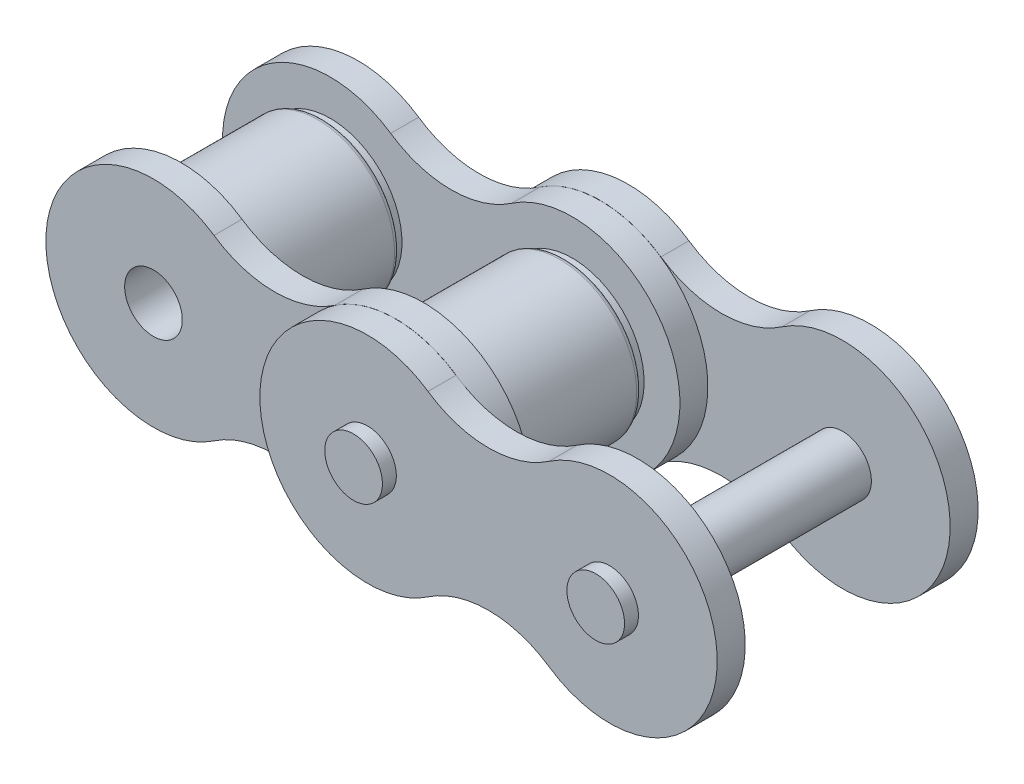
ISO-10303-21;
HEADER;
FILE_DESCRIPTION(('STEP AP214'),'2;1');
FILE_NAME('part.step','',(''),(''),'','','');
FILE_SCHEMA(('AUTOMOTIVE_DESIGN { 1 0 10303 214 1 1 1 1 }'));
ENDSEC;
DATA;
#1=APPLICATION_CONTEXT('core data for automotive mechanical design processes');
#2=APPLICATION_PROTOCOL_DEFINITION('international standard','automotive_design',2000,#1);
#3=PRODUCT_CONTEXT('',#1,'mechanical');
#4=PRODUCT('Part','Part','',(#3));
#5=PRODUCT_RELATED_PRODUCT_CATEGORY('part','',(#4));
#6=PRODUCT_DEFINITION_FORMATION('','',#4);
#7=PRODUCT_DEFINITION_CONTEXT('part definition',#1,'design');
#8=PRODUCT_DEFINITION('design','',#6,#7);
#9=PRODUCT_DEFINITION_SHAPE('','',#8);
#10=(LENGTH_UNIT() NAMED_UNIT(*) SI_UNIT(.MILLI.,.METRE.));
#11=(NAMED_UNIT(*) PLANE_ANGLE_UNIT() SI_UNIT($,.RADIAN.));
#12=(NAMED_UNIT(*) SI_UNIT($,.STERADIAN.) SOLID_ANGLE_UNIT());
#13=UNCERTAINTY_MEASURE_WITH_UNIT(LENGTH_MEASURE(1.E-05),#10,'distance_accuracy_value','');
#14=(GEOMETRIC_REPRESENTATION_CONTEXT(3) GLOBAL_UNCERTAINTY_ASSIGNED_CONTEXT((#13)) GLOBAL_UNIT_ASSIGNED_CONTEXT((#10,
#11,#12)) REPRESENTATION_CONTEXT('',''));
#15=CARTESIAN_POINT('',(0.,0.,0.));
#16=DIRECTION('',(0.,0.,1.));
#17=DIRECTION('',(1.,0.,0.));
#18=AXIS2_PLACEMENT_3D('',#15,#16,#17);
#19=CARTESIAN_POINT('',(23.8125,7.00001542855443,10.264));
#20=DIRECTION('',(0.,0.,-1.));
#21=DIRECTION('',(-1.,0.,0.));
#22=AXIS2_PLACEMENT_3D('',#19,#20,#21);
#23=PLANE('',#22);
#24=CARTESIAN_POINT('',(19.05,0.,10.264));
#25=DIRECTION('',(0.,0.,-1.));
#26=DIRECTION('',(-1.,0.,0.));
#27=AXIS2_PLACEMENT_3D('',#24,#25,#26);
#28=CIRCLE('',#27,2.26875);
#29=CARTESIAN_POINT('',(16.78125,0.,10.264));
#30=VERTEX_POINT('',#29);
#31=EDGE_CURVE('E338',#30,#30,#28,.T.);
#32=ORIENTED_EDGE('',*,*,#31,.T.);
#33=EDGE_LOOP('',(#32));
#34=FACE_BOUND('',#33,.T.);
#35=CARTESIAN_POINT('',(28.575,14.0000308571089,10.264));
#36=DIRECTION('',(0.,0.,-1.));
#37=DIRECTION('',(-1.,0.,0.));
#38=AXIS2_PLACEMENT_3D('',#35,#36,#37);
#39=CIRCLE('',#38,8.46650000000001);
#40=CARTESIAN_POINT('',(33.3375,7.00001542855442,10.264));
#41=VERTEX_POINT('',#40);
#42=CARTESIAN_POINT('',(23.8125,7.00001542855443,10.264));
#43=VERTEX_POINT('',#42);
#44=EDGE_CURVE('E202',#41,#43,#39,.T.);
#45=ORIENTED_EDGE('',*,*,#44,.T.);
#46=CARTESIAN_POINT('',(19.05,0.,10.264));
#47=DIRECTION('',(0.,0.,1.));
#48=DIRECTION('',(1.,0.,0.));
#49=AXIS2_PLACEMENT_3D('',#46,#47,#48);
#50=CIRCLE('',#49,8.4665);
#51=CARTESIAN_POINT('',(23.8125,-7.00001542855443,10.264));
#52=VERTEX_POINT('',#51);
#53=EDGE_CURVE('E205',#43,#52,#50,.T.);
#54=ORIENTED_EDGE('',*,*,#53,.T.);
#55=CARTESIAN_POINT('',(28.575,-14.0000308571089,10.264));
#56=DIRECTION('',(0.,0.,-1.));
#57=DIRECTION('',(-1.,0.,0.));
#58=AXIS2_PLACEMENT_3D('',#55,#56,#57);
#59=CIRCLE('',#58,8.46650000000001);
#60=CARTESIAN_POINT('',(33.3375,-7.00001542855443,10.264));
#61=VERTEX_POINT('',#60);
#62=EDGE_CURVE('E208',#52,#61,#59,.T.);
#63=ORIENTED_EDGE('',*,*,#62,.T.);
#64=CARTESIAN_POINT('',(38.1,0.,10.264));
#65=DIRECTION('',(0.,0.,1.));
#66=DIRECTION('',(1.,0.,0.));
#67=AXIS2_PLACEMENT_3D('',#64,#65,#66);
#68=CIRCLE('',#67,8.4665);
#69=EDGE_CURVE('E210',#61,#41,#68,.T.);
#70=ORIENTED_EDGE('',*,*,#69,.T.);
#71=EDGE_LOOP('',(#45,#54,#63,#70));
#72=FACE_BOUND('',#71,.T.);
#73=CARTESIAN_POINT('',(38.1,0.,10.264));
#74=DIRECTION('',(0.,0.,-1.));
#75=DIRECTION('',(-1.,0.,0.));
#76=AXIS2_PLACEMENT_3D('',#73,#74,#75);
#77=CIRCLE('',#76,2.26875);
#78=CARTESIAN_POINT('',(35.83125,0.,10.264));
#79=VERTEX_POINT('',#78);
#80=EDGE_CURVE('E11',#79,#79,#77,.F.);
#81=ORIENTED_EDGE('',*,*,#80,.F.);
#82=EDGE_LOOP('',(#81));
#83=FACE_BOUND('',#82,.T.);
#84=ADVANCED_FACE('F31',(#34,#72,#83),#23,.F.);
#85=CARTESIAN_POINT('',(23.8125,7.00001542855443,8.062));
#86=DIRECTION('',(0.,0.,-1.));
#87=DIRECTION('',(-1.,0.,0.));
#88=AXIS2_PLACEMENT_3D('',#85,#86,#87);
#89=PLANE('',#88);
#90=CARTESIAN_POINT('',(19.05,0.,8.062));
#91=DIRECTION('',(0.,0.,-1.));
#92=DIRECTION('',(-1.,0.,0.));
#93=AXIS2_PLACEMENT_3D('',#90,#91,#92);
#94=CIRCLE('',#93,2.26875);
#95=CARTESIAN_POINT('',(16.78125,0.,8.062));
#96=VERTEX_POINT('',#95);
#97=EDGE_CURVE('E232',#96,#96,#94,.T.);
#98=ORIENTED_EDGE('',*,*,#97,.F.);
#99=EDGE_LOOP('',(#98));
#100=FACE_BOUND('',#99,.T.);
#101=CARTESIAN_POINT('',(28.575,14.0000308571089,8.062));
#102=DIRECTION('',(0.,0.,-1.));
#103=DIRECTION('',(-1.,0.,0.));
#104=AXIS2_PLACEMENT_3D('',#101,#102,#103);
#105=CIRCLE('',#104,8.46650000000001);
#106=CARTESIAN_POINT('',(33.3375,7.00001542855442,8.062));
#107=VERTEX_POINT('',#106);
#108=CARTESIAN_POINT('',(23.8125,7.00001542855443,8.062));
#109=VERTEX_POINT('',#108);
#110=EDGE_CURVE('E213',#107,#109,#105,.T.);
#111=ORIENTED_EDGE('',*,*,#110,.F.);
#112=CARTESIAN_POINT('',(38.1,0.,8.062));
#113=DIRECTION('',(0.,0.,1.));
#114=DIRECTION('',(1.,0.,0.));
#115=AXIS2_PLACEMENT_3D('',#112,#113,#114);
#116=CIRCLE('',#115,8.4665);
#117=CARTESIAN_POINT('',(33.3375,-7.00001542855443,8.062));
#118=VERTEX_POINT('',#117);
#119=EDGE_CURVE('E206',#118,#107,#116,.T.);
#120=ORIENTED_EDGE('',*,*,#119,.F.);
#121=CARTESIAN_POINT('',(28.575,-14.0000308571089,8.062));
#122=DIRECTION('',(0.,0.,-1.));
#123=DIRECTION('',(-1.,0.,0.));
#124=AXIS2_PLACEMENT_3D('',#121,#122,#123);
#125=CIRCLE('',#124,8.46650000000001);
#126=CARTESIAN_POINT('',(23.8125,-7.00001542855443,8.062));
#127=VERTEX_POINT('',#126);
#128=EDGE_CURVE('E218',#127,#118,#125,.T.);
#129=ORIENTED_EDGE('',*,*,#128,.F.);
#130=CARTESIAN_POINT('',(19.05,0.,8.062));
#131=DIRECTION('',(0.,0.,1.));
#132=DIRECTION('',(1.,0.,0.));
#133=AXIS2_PLACEMENT_3D('',#130,#131,#132);
#134=CIRCLE('',#133,8.4665);
#135=EDGE_CURVE('E216',#109,#127,#134,.T.);
#136=ORIENTED_EDGE('',*,*,#135,.F.);
#137=EDGE_LOOP('',(#111,#120,#129,#136));
#138=FACE_BOUND('',#137,.T.);
#139=CARTESIAN_POINT('',(38.1,0.,8.062));
#140=DIRECTION('',(0.,0.,-1.));
#141=DIRECTION('',(-1.,0.,0.));
#142=AXIS2_PLACEMENT_3D('',#139,#140,#141);
#143=CIRCLE('',#142,2.26875);
#144=CARTESIAN_POINT('',(35.83125,0.,8.062));
#145=VERTEX_POINT('',#144);
#146=EDGE_CURVE('E193',#145,#145,#143,.F.);
#147=ORIENTED_EDGE('',*,*,#146,.T.);
#148=EDGE_LOOP('',(#147));
#149=FACE_BOUND('',#148,.T.);
#150=ADVANCED_FACE('F355',(#100,#138,#149),#89,.T.);
#151=CARTESIAN_POINT('',(23.8125,7.00001542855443,-10.264));
#152=DIRECTION('',(0.,0.,-1.));
#153=DIRECTION('',(-1.,0.,0.));
#154=AXIS2_PLACEMENT_3D('',#151,#152,#153);
#155=PLANE('',#154);
#156=CARTESIAN_POINT('',(19.05,0.,-10.264));
#157=DIRECTION('',(0.,0.,-1.));
#158=DIRECTION('',(-1.,0.,0.));
#159=AXIS2_PLACEMENT_3D('',#156,#157,#158);
#160=CIRCLE('',#159,2.26875);
#161=CARTESIAN_POINT('',(16.78125,0.,-10.264));
#162=VERTEX_POINT('',#161);
#163=EDGE_CURVE('E198',#162,#162,#160,.T.);
#164=ORIENTED_EDGE('',*,*,#163,.F.);
#165=EDGE_LOOP('',(#164));
#166=FACE_BOUND('',#165,.T.);
#167=CARTESIAN_POINT('',(28.575,14.0000308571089,-10.264));
#168=DIRECTION('',(0.,0.,-1.));
#169=DIRECTION('',(-1.,0.,0.));
#170=AXIS2_PLACEMENT_3D('',#167,#168,#169);
#171=CIRCLE('',#170,8.46650000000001);
#172=CARTESIAN_POINT('',(33.3375,7.00001542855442,-10.264));
#173=VERTEX_POINT('',#172);
#174=CARTESIAN_POINT('',(23.8125,7.00001542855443,-10.264));
#175=VERTEX_POINT('',#174);
#176=EDGE_CURVE('E175',#173,#175,#171,.T.);
#177=ORIENTED_EDGE('',*,*,#176,.F.);
#178=CARTESIAN_POINT('',(38.1,0.,-10.264));
#179=DIRECTION('',(0.,0.,1.));
#180=DIRECTION('',(1.,0.,0.));
#181=AXIS2_PLACEMENT_3D('',#178,#179,#180);
#182=CIRCLE('',#181,8.4665);
#183=CARTESIAN_POINT('',(33.3375,-7.00001542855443,-10.264));
#184=VERTEX_POINT('',#183);
#185=EDGE_CURVE('E167',#184,#173,#182,.T.);
#186=ORIENTED_EDGE('',*,*,#185,.F.);
#187=CARTESIAN_POINT('',(28.575,-14.0000308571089,-10.264));
#188=DIRECTION('',(0.,0.,-1.));
#189=DIRECTION('',(-1.,0.,0.));
#190=AXIS2_PLACEMENT_3D('',#187,#188,#189);
#191=CIRCLE('',#190,8.46650000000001);
#192=CARTESIAN_POINT('',(23.8125,-7.00001542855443,-10.264));
#193=VERTEX_POINT('',#192);
#194=EDGE_CURVE('E178',#193,#184,#191,.T.);
#195=ORIENTED_EDGE('',*,*,#194,.F.);
#196=CARTESIAN_POINT('',(19.05,0.,-10.264));
#197=DIRECTION('',(0.,0.,1.));
#198=DIRECTION('',(1.,0.,0.));
#199=AXIS2_PLACEMENT_3D('',#196,#197,#198);
#200=CIRCLE('',#199,8.4665);
#201=EDGE_CURVE('E159',#175,#193,#200,.T.);
#202=ORIENTED_EDGE('',*,*,#201,.F.);
#203=EDGE_LOOP('',(#177,#186,#195,#202));
#204=FACE_BOUND('',#203,.T.);
#205=CARTESIAN_POINT('',(38.1,0.,-10.264));
#206=DIRECTION('',(0.,0.,-1.));
#207=DIRECTION('',(-1.,0.,0.));
#208=AXIS2_PLACEMENT_3D('',#205,#206,#207);
#209=CIRCLE('',#208,2.26875);
#210=CARTESIAN_POINT('',(35.83125,0.,-10.264));
#211=VERTEX_POINT('',#210);
#212=EDGE_CURVE('E630',#211,#211,#209,.F.);
#213=ORIENTED_EDGE('',*,*,#212,.T.);
#214=EDGE_LOOP('',(#213));
#215=FACE_BOUND('',#214,.T.);
#216=ADVANCED_FACE('F172',(#166,#204,#215),#155,.T.);
#217=CARTESIAN_POINT('',(23.8125,7.00001542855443,-8.062));
#218=DIRECTION('',(0.,0.,-1.));
#219=DIRECTION('',(-1.,0.,0.));
#220=AXIS2_PLACEMENT_3D('',#217,#218,#219);
#221=PLANE('',#220);
#222=CARTESIAN_POINT('',(19.05,0.,-8.062));
#223=DIRECTION('',(0.,0.,-1.));
#224=DIRECTION('',(-1.,0.,0.));
#225=AXIS2_PLACEMENT_3D('',#222,#223,#224);
#226=CIRCLE('',#225,2.26875);
#227=CARTESIAN_POINT('',(16.78125,0.,-8.062));
#228=VERTEX_POINT('',#227);
#229=EDGE_CURVE('E345',#228,#228,#226,.T.);
#230=ORIENTED_EDGE('',*,*,#229,.T.);
#231=EDGE_LOOP('',(#230));
#232=FACE_BOUND('',#231,.T.);
#233=CARTESIAN_POINT('',(28.575,14.0000308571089,-8.062));
#234=DIRECTION('',(0.,0.,-1.));
#235=DIRECTION('',(-1.,0.,0.));
#236=AXIS2_PLACEMENT_3D('',#233,#234,#235);
#237=CIRCLE('',#236,8.46650000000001);
#238=CARTESIAN_POINT('',(33.3375,7.00001542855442,-8.062));
#239=VERTEX_POINT('',#238);
#240=CARTESIAN_POINT('',(23.8125,7.00001542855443,-8.062));
#241=VERTEX_POINT('',#240);
#242=EDGE_CURVE('E191',#239,#241,#237,.T.);
#243=ORIENTED_EDGE('',*,*,#242,.T.);
#244=CARTESIAN_POINT('',(19.05,0.,-8.062));
#245=DIRECTION('',(0.,0.,1.));
#246=DIRECTION('',(1.,0.,0.));
#247=AXIS2_PLACEMENT_3D('',#244,#245,#246);
#248=CIRCLE('',#247,8.4665);
#249=CARTESIAN_POINT('',(23.8125,-7.00001542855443,-8.062));
#250=VERTEX_POINT('',#249);
#251=EDGE_CURVE('E161',#241,#250,#248,.T.);
#252=ORIENTED_EDGE('',*,*,#251,.T.);
#253=CARTESIAN_POINT('',(28.575,-14.0000308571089,-8.062));
#254=DIRECTION('',(0.,0.,-1.));
#255=DIRECTION('',(-1.,0.,0.));
#256=AXIS2_PLACEMENT_3D('',#253,#254,#255);
#257=CIRCLE('',#256,8.46650000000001);
#258=CARTESIAN_POINT('',(33.3375,-7.00001542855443,-8.062));
#259=VERTEX_POINT('',#258);
#260=EDGE_CURVE('E185',#250,#259,#257,.T.);
#261=ORIENTED_EDGE('',*,*,#260,.T.);
#262=CARTESIAN_POINT('',(38.1,0.,-8.062));
#263=DIRECTION('',(0.,0.,1.));
#264=DIRECTION('',(1.,0.,0.));
#265=AXIS2_PLACEMENT_3D('',#262,#263,#264);
#266=CIRCLE('',#265,8.4665);
#267=EDGE_CURVE('E182',#259,#239,#266,.T.);
#268=ORIENTED_EDGE('',*,*,#267,.T.);
#269=EDGE_LOOP('',(#243,#252,#261,#268));
#270=FACE_BOUND('',#269,.T.);
#271=CARTESIAN_POINT('',(38.1,0.,-8.062));
#272=DIRECTION('',(0.,0.,-1.));
#273=DIRECTION('',(-1.,0.,0.));
#274=AXIS2_PLACEMENT_3D('',#271,#272,#273);
#275=CIRCLE('',#274,2.26875);
#276=CARTESIAN_POINT('',(35.83125,0.,-8.062));
#277=VERTEX_POINT('',#276);
#278=EDGE_CURVE('E35',#277,#277,#275,.F.);
#279=ORIENTED_EDGE('',*,*,#278,.F.);
#280=EDGE_LOOP('',(#279));
#281=FACE_BOUND('',#280,.T.);
#282=ADVANCED_FACE('F354',(#232,#270,#281),#221,.F.);
#283=CARTESIAN_POINT('',(19.05,0.,11.355));
#284=DIRECTION('',(0.,0.,-1.));
#285=DIRECTION('',(-1.,0.,0.));
#286=AXIS2_PLACEMENT_3D('',#283,#284,#285);
#287=CYLINDRICAL_SURFACE('',#286,2.26875);
#288=CARTESIAN_POINT('',(19.05,0.,-8.052));
#289=DIRECTION('',(0.,0.,-1.));
#290=DIRECTION('',(-1.,0.,0.));
#291=AXIS2_PLACEMENT_3D('',#288,#289,#290);
#292=CIRCLE('',#291,2.26875);
#293=CARTESIAN_POINT('',(16.78125,0.,-8.052));
#294=VERTEX_POINT('',#293);
#295=EDGE_CURVE('E258',#294,#294,#292,.F.);
#296=ORIENTED_EDGE('',*,*,#295,.F.);
#297=EDGE_LOOP('',(#296));
#298=FACE_BOUND('',#297,.T.);
#299=ORIENTED_EDGE('',*,*,#229,.F.);
#300=EDGE_LOOP('',(#299));
#301=FACE_BOUND('',#300,.T.);
#302=ADVANCED_FACE('F361',(#298,#301),#287,.T.);
#303=CARTESIAN_POINT('',(4.7625,7.00001542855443,8.052));
#304=DIRECTION('',(0.,0.,-1.));
#305=DIRECTION('',(-1.,0.,0.));
#306=AXIS2_PLACEMENT_3D('',#303,#304,#305);
#307=PLANE('',#306);
#308=CARTESIAN_POINT('',(19.05,0.,8.052));
#309=DIRECTION('',(0.,0.,-1.));
#310=DIRECTION('',(-1.,0.,0.));
#311=AXIS2_PLACEMENT_3D('',#308,#309,#310);
#312=CIRCLE('',#311,2.26875);
#313=CARTESIAN_POINT('',(16.78125,0.,8.052));
#314=VERTEX_POINT('',#313);
#315=EDGE_CURVE('E335',#314,#314,#312,.F.);
#316=ORIENTED_EDGE('',*,*,#315,.F.);
#317=EDGE_LOOP('',(#316));
#318=FACE_BOUND('',#317,.T.);
#319=CARTESIAN_POINT('',(9.525,14.0000308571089,8.052));
#320=DIRECTION('',(0.,0.,-1.));
#321=DIRECTION('',(-1.,0.,0.));
#322=AXIS2_PLACEMENT_3D('',#319,#320,#321);
#323=CIRCLE('',#322,8.46650000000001);
#324=CARTESIAN_POINT('',(14.2875,7.00001542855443,8.052));
#325=VERTEX_POINT('',#324);
#326=CARTESIAN_POINT('',(4.7625,7.00001542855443,8.052));
#327=VERTEX_POINT('',#326);
#328=EDGE_CURVE('E292',#325,#327,#323,.T.);
#329=ORIENTED_EDGE('',*,*,#328,.T.);
#330=CARTESIAN_POINT('',(0.,0.,8.052));
#331=DIRECTION('',(0.,0.,1.));
#332=DIRECTION('',(1.,0.,0.));
#333=AXIS2_PLACEMENT_3D('',#330,#331,#332);
#334=CIRCLE('',#333,8.4665);
#335=CARTESIAN_POINT('',(4.7625,-7.00001542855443,8.052));
#336=VERTEX_POINT('',#335);
#337=EDGE_CURVE('E81',#327,#336,#334,.T.);
#338=ORIENTED_EDGE('',*,*,#337,.T.);
#339=CARTESIAN_POINT('',(9.525,-14.0000308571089,8.052));
#340=DIRECTION('',(0.,0.,-1.));
#341=DIRECTION('',(-1.,0.,0.));
#342=AXIS2_PLACEMENT_3D('',#339,#340,#341);
#343=CIRCLE('',#342,8.46650000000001);
#344=CARTESIAN_POINT('',(14.2875,-7.00001542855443,8.052));
#345=VERTEX_POINT('',#344);
#346=EDGE_CURVE('E295',#336,#345,#343,.T.);
#347=ORIENTED_EDGE('',*,*,#346,.T.);
#348=CARTESIAN_POINT('',(19.05,0.,8.052));
#349=DIRECTION('',(0.,0.,1.));
#350=DIRECTION('',(1.,0.,0.));
#351=AXIS2_PLACEMENT_3D('',#348,#349,#350);
#352=CIRCLE('',#351,8.4665);
#353=EDGE_CURVE('E49',#345,#325,#352,.T.);
#354=ORIENTED_EDGE('',*,*,#353,.T.);
#355=EDGE_LOOP('',(#329,#338,#347,#354));
#356=FACE_BOUND('',#355,.T.);
#357=CARTESIAN_POINT('',(0.,0.,8.052));
#358=DIRECTION('',(0.,0.,-1.));
#359=DIRECTION('',(-1.,0.,0.));
#360=AXIS2_PLACEMENT_3D('',#357,#358,#359);
#361=CIRCLE('',#360,2.26875);
#362=CARTESIAN_POINT('',(-2.26875,0.,8.052));
#363=VERTEX_POINT('',#362);
#364=EDGE_CURVE('E233',#363,#363,#361,.F.);
#365=ORIENTED_EDGE('',*,*,#364,.F.);
#366=EDGE_LOOP('',(#365));
#367=FACE_BOUND('',#366,.T.);
#368=ADVANCED_FACE('F437',(#318,#356,#367),#307,.F.);
#369=CARTESIAN_POINT('',(4.7625,7.00001542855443,-8.052));
#370=DIRECTION('',(0.,0.,-1.));
#371=DIRECTION('',(-1.,0.,0.));
#372=AXIS2_PLACEMENT_3D('',#369,#370,#371);
#373=PLANE('',#372);
#374=ORIENTED_EDGE('',*,*,#295,.T.);
#375=EDGE_LOOP('',(#374));
#376=FACE_BOUND('',#375,.T.);
#377=CARTESIAN_POINT('',(9.525,14.0000308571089,-8.052));
#378=DIRECTION('',(0.,0.,-1.));
#379=DIRECTION('',(-1.,0.,0.));
#380=AXIS2_PLACEMENT_3D('',#377,#378,#379);
#381=CIRCLE('',#380,8.46650000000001);
#382=CARTESIAN_POINT('',(14.2875,7.00001542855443,-8.052));
#383=VERTEX_POINT('',#382);
#384=CARTESIAN_POINT('',(4.7625,7.00001542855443,-8.052));
#385=VERTEX_POINT('',#384);
#386=EDGE_CURVE('E259',#383,#385,#381,.T.);
#387=ORIENTED_EDGE('',*,*,#386,.F.);
#388=CARTESIAN_POINT('',(19.05,0.,-8.052));
#389=DIRECTION('',(0.,0.,1.));
#390=DIRECTION('',(1.,0.,0.));
#391=AXIS2_PLACEMENT_3D('',#388,#389,#390);
#392=CIRCLE('',#391,8.4665);
#393=CARTESIAN_POINT('',(14.2875,-7.00001542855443,-8.052));
#394=VERTEX_POINT('',#393);
#395=EDGE_CURVE('E269',#394,#383,#392,.T.);
#396=ORIENTED_EDGE('',*,*,#395,.F.);
#397=CARTESIAN_POINT('',(9.525,-14.0000308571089,-8.052));
#398=DIRECTION('',(0.,0.,-1.));
#399=DIRECTION('',(-1.,0.,0.));
#400=AXIS2_PLACEMENT_3D('',#397,#398,#399);
#401=CIRCLE('',#400,8.46650000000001);
#402=CARTESIAN_POINT('',(4.7625,-7.00001542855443,-8.052));
#403=VERTEX_POINT('',#402);
#404=EDGE_CURVE('E266',#403,#394,#401,.T.);
#405=ORIENTED_EDGE('',*,*,#404,.F.);
#406=CARTESIAN_POINT('',(0.,0.,-8.052));
#407=DIRECTION('',(0.,0.,1.));
#408=DIRECTION('',(1.,0.,0.));
#409=AXIS2_PLACEMENT_3D('',#406,#407,#408);
#410=CIRCLE('',#409,8.4665);
#411=EDGE_CURVE('E262',#385,#403,#410,.T.);
#412=ORIENTED_EDGE('',*,*,#411,.F.);
#413=EDGE_LOOP('',(#387,#396,#405,#412));
#414=FACE_BOUND('',#413,.T.);
#415=CARTESIAN_POINT('',(0.,0.,-8.052));
#416=DIRECTION('',(0.,0.,-1.));
#417=DIRECTION('',(-1.,0.,0.));
#418=AXIS2_PLACEMENT_3D('',#415,#416,#417);
#419=CIRCLE('',#418,2.26875);
#420=CARTESIAN_POINT('',(-2.26875,0.,-8.052));
#421=VERTEX_POINT('',#420);
#422=EDGE_CURVE('E237',#421,#421,#419,.F.);
#423=ORIENTED_EDGE('',*,*,#422,.T.);
#424=EDGE_LOOP('',(#423));
#425=FACE_BOUND('',#424,.T.);
#426=ADVANCED_FACE('F433',(#376,#414,#425),#373,.T.);
#427=CARTESIAN_POINT('',(4.7625,7.00001542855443,5.85));
#428=DIRECTION('',(0.,0.,-1.));
#429=DIRECTION('',(-1.,0.,0.));
#430=AXIS2_PLACEMENT_3D('',#427,#428,#429);
#431=PLANE('',#430);
#432=CARTESIAN_POINT('',(9.525,14.0000308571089,5.85));
#433=DIRECTION('',(0.,0.,-1.));
#434=DIRECTION('',(-1.,0.,0.));
#435=AXIS2_PLACEMENT_3D('',#432,#433,#434);
#436=CIRCLE('',#435,8.46650000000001);
#437=CARTESIAN_POINT('',(14.2875,7.00001542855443,5.85));
#438=VERTEX_POINT('',#437);
#439=CARTESIAN_POINT('',(4.7625,7.00001542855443,5.85));
#440=VERTEX_POINT('',#439);
#441=EDGE_CURVE('E286',#438,#440,#436,.T.);
#442=ORIENTED_EDGE('',*,*,#441,.F.);
#443=CARTESIAN_POINT('',(19.05,0.,5.85));
#444=DIRECTION('',(0.,0.,1.));
#445=DIRECTION('',(1.,0.,0.));
#446=AXIS2_PLACEMENT_3D('',#443,#444,#445);
#447=CIRCLE('',#446,8.4665);
#448=CARTESIAN_POINT('',(14.2875,-7.00001542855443,5.85));
#449=VERTEX_POINT('',#448);
#450=EDGE_CURVE('E73',#449,#438,#447,.T.);
#451=ORIENTED_EDGE('',*,*,#450,.F.);
#452=CARTESIAN_POINT('',(9.525,-14.0000308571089,5.85));
#453=DIRECTION('',(0.,0.,-1.));
#454=DIRECTION('',(-1.,0.,0.));
#455=AXIS2_PLACEMENT_3D('',#452,#453,#454);
#456=CIRCLE('',#455,8.46650000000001);
#457=CARTESIAN_POINT('',(4.7625,-7.00001542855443,5.85));
#458=VERTEX_POINT('',#457);
#459=EDGE_CURVE('E67',#458,#449,#456,.T.);
#460=ORIENTED_EDGE('',*,*,#459,.F.);
#461=CARTESIAN_POINT('',(0.,0.,5.85));
#462=DIRECTION('',(0.,0.,1.));
#463=DIRECTION('',(1.,0.,0.));
#464=AXIS2_PLACEMENT_3D('',#461,#462,#463);
#465=CIRCLE('',#464,8.4665);
#466=EDGE_CURVE('E301',#440,#458,#465,.T.);
#467=ORIENTED_EDGE('',*,*,#466,.F.);
#468=EDGE_LOOP('',(#442,#451,#460,#467));
#469=FACE_BOUND('',#468,.T.);
#470=CARTESIAN_POINT('',(0.,0.,5.85));
#471=DIRECTION('',(0.,0.,-1.));
#472=DIRECTION('',(-1.,0.,0.));
#473=AXIS2_PLACEMENT_3D('',#470,#471,#472);
#474=CIRCLE('',#473,5.65);
#475=CARTESIAN_POINT('',(-5.65,0.,5.85));
#476=VERTEX_POINT('',#475);
#477=EDGE_CURVE('E312',#476,#476,#474,.T.);
#478=ORIENTED_EDGE('',*,*,#477,.F.);
#479=EDGE_LOOP('',(#478));
#480=FACE_BOUND('',#479,.T.);
#481=CARTESIAN_POINT('',(19.05,0.,5.85));
#482=DIRECTION('',(0.,0.,-1.));
#483=DIRECTION('',(-1.,0.,0.));
#484=AXIS2_PLACEMENT_3D('',#481,#482,#483);
#485=CIRCLE('',#484,5.65000000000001);
#486=CARTESIAN_POINT('',(13.4,0.,5.85));
#487=VERTEX_POINT('',#486);
#488=EDGE_CURVE('E240',#487,#487,#485,.T.);
#489=ORIENTED_EDGE('',*,*,#488,.F.);
#490=EDGE_LOOP('',(#489));
#491=FACE_BOUND('',#490,.T.);
#492=ADVANCED_FACE('F436',(#469,#480,#491),#431,.T.);
#493=CARTESIAN_POINT('',(4.7625,7.00001542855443,-5.85));
#494=DIRECTION('',(0.,0.,-1.));
#495=DIRECTION('',(-1.,0.,0.));
#496=AXIS2_PLACEMENT_3D('',#493,#494,#495);
#497=PLANE('',#496);
#498=CARTESIAN_POINT('',(0.,0.,-5.85));
#499=DIRECTION('',(0.,0.,-1.));
#500=DIRECTION('',(-1.,0.,0.));
#501=AXIS2_PLACEMENT_3D('',#498,#499,#500);
#502=CIRCLE('',#501,5.65);
#503=CARTESIAN_POINT('',(-5.65,0.,-5.85));
#504=VERTEX_POINT('',#503);
#505=EDGE_CURVE('E327',#504,#504,#502,.T.);
#506=ORIENTED_EDGE('',*,*,#505,.T.);
#507=EDGE_LOOP('',(#506));
#508=FACE_BOUND('',#507,.T.);
#509=CARTESIAN_POINT('',(9.525,14.0000308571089,-5.85));
#510=DIRECTION('',(0.,0.,-1.));
#511=DIRECTION('',(-1.,0.,0.));
#512=AXIS2_PLACEMENT_3D('',#509,#510,#511);
#513=CIRCLE('',#512,8.46650000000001);
#514=CARTESIAN_POINT('',(14.2875,7.00001542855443,-5.85));
#515=VERTEX_POINT('',#514);
#516=CARTESIAN_POINT('',(4.7625,7.00001542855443,-5.85));
#517=VERTEX_POINT('',#516);
#518=EDGE_CURVE('E273',#515,#517,#513,.T.);
#519=ORIENTED_EDGE('',*,*,#518,.T.);
#520=CARTESIAN_POINT('',(0.,0.,-5.85));
#521=DIRECTION('',(0.,0.,1.));
#522=DIRECTION('',(1.,0.,0.));
#523=AXIS2_PLACEMENT_3D('',#520,#521,#522);
#524=CIRCLE('',#523,8.4665);
#525=CARTESIAN_POINT('',(4.7625,-7.00001542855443,-5.85));
#526=VERTEX_POINT('',#525);
#527=EDGE_CURVE('E276',#517,#526,#524,.T.);
#528=ORIENTED_EDGE('',*,*,#527,.T.);
#529=CARTESIAN_POINT('',(9.525,-14.0000308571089,-5.85));
#530=DIRECTION('',(0.,0.,-1.));
#531=DIRECTION('',(-1.,0.,0.));
#532=AXIS2_PLACEMENT_3D('',#529,#530,#531);
#533=CIRCLE('',#532,8.46650000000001);
#534=CARTESIAN_POINT('',(14.2875,-7.00001542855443,-5.85));
#535=VERTEX_POINT('',#534);
#536=EDGE_CURVE('E279',#526,#535,#533,.T.);
#537=ORIENTED_EDGE('',*,*,#536,.T.);
#538=CARTESIAN_POINT('',(19.05,0.,-5.85));
#539=DIRECTION('',(0.,0.,1.));
#540=DIRECTION('',(1.,0.,0.));
#541=AXIS2_PLACEMENT_3D('',#538,#539,#540);
#542=CIRCLE('',#541,8.4665);
#543=EDGE_CURVE('E263',#535,#515,#542,.T.);
#544=ORIENTED_EDGE('',*,*,#543,.T.);
#545=EDGE_LOOP('',(#519,#528,#537,#544));
#546=FACE_BOUND('',#545,.T.);
#547=CARTESIAN_POINT('',(19.05,0.,-5.85));
#548=DIRECTION('',(0.,0.,-1.));
#549=DIRECTION('',(-1.,0.,0.));
#550=AXIS2_PLACEMENT_3D('',#547,#548,#549);
#551=CIRCLE('',#550,5.65000000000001);
#552=CARTESIAN_POINT('',(13.4,0.,-5.85));
#553=VERTEX_POINT('',#552);
#554=EDGE_CURVE('E330',#553,#553,#551,.F.);
#555=ORIENTED_EDGE('',*,*,#554,.F.);
#556=EDGE_LOOP('',(#555));
#557=FACE_BOUND('',#556,.T.);
#558=ADVANCED_FACE('F439',(#508,#546,#557),#497,.F.);
#559=CARTESIAN_POINT('',(0.,0.,5.85));
#560=DIRECTION('',(0.,0.,-1.));
#561=DIRECTION('',(-1.,0.,0.));
#562=AXIS2_PLACEMENT_3D('',#559,#560,#561);
#563=CYLINDRICAL_SURFACE('',#562,5.65);
#564=ORIENTED_EDGE('',*,*,#505,.F.);
#565=EDGE_LOOP('',(#564));
#566=FACE_BOUND('',#565,.T.);
#567=CARTESIAN_POINT('',(0.,0.,-5.265));
#568=DIRECTION('',(0.,0.,-1.));
#569=DIRECTION('',(-1.,0.,0.));
#570=AXIS2_PLACEMENT_3D('',#567,#568,#569);
#571=CIRCLE('',#570,5.65);
#572=CARTESIAN_POINT('',(-5.65,0.,-5.265));
#573=VERTEX_POINT('',#572);
#574=EDGE_CURVE('E324',#573,#573,#571,.T.);
#575=ORIENTED_EDGE('',*,*,#574,.T.);
#576=EDGE_LOOP('',(#575));
#577=FACE_BOUND('',#576,.T.);
#578=ADVANCED_FACE('F33',(#566,#577),#563,.T.);
#579=CARTESIAN_POINT('',(0.,0.,-4.865));
#580=DIRECTION('',(0.,0.,-1.));
#581=DIRECTION('',(-1.,0.,0.));
#582=AXIS2_PLACEMENT_3D('',#579,#580,#581);
#583=TOROIDAL_SURFACE('',#582,5.65,0.399999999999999);
#584=ORIENTED_EDGE('',*,*,#574,.F.);
#585=EDGE_LOOP('',(#584));
#586=FACE_BOUND('',#585,.T.);
#587=CARTESIAN_POINT('',(0.,0.,-4.865));
#588=DIRECTION('',(0.,0.,-1.));
#589=DIRECTION('',(-1.,0.,0.));
#590=AXIS2_PLACEMENT_3D('',#587,#588,#589);
#591=CIRCLE('',#590,6.05);
#592=CARTESIAN_POINT('',(-6.05,0.,-4.865));
#593=VERTEX_POINT('',#592);
#594=EDGE_CURVE('E321',#593,#593,#591,.T.);
#595=ORIENTED_EDGE('',*,*,#594,.T.);
#596=EDGE_LOOP('',(#595));
#597=FACE_BOUND('',#596,.T.);
#598=ADVANCED_FACE('F487',(#586,#597),#583,.T.);
#599=CARTESIAN_POINT('',(0.,0.,5.85));
#600=DIRECTION('',(0.,0.,-1.));
#601=DIRECTION('',(-1.,0.,0.));
#602=AXIS2_PLACEMENT_3D('',#599,#600,#601);
#603=CYLINDRICAL_SURFACE('',#602,6.05);
#604=ORIENTED_EDGE('',*,*,#594,.F.);
#605=EDGE_LOOP('',(#604));
#606=FACE_BOUND('',#605,.T.);
#607=CARTESIAN_POINT('',(0.,0.,4.865));
#608=DIRECTION('',(0.,0.,-1.));
#609=DIRECTION('',(-1.,0.,0.));
#610=AXIS2_PLACEMENT_3D('',#607,#608,#609);
#611=CIRCLE('',#610,6.05);
#612=CARTESIAN_POINT('',(-6.05,0.,4.865));
#613=VERTEX_POINT('',#612);
#614=EDGE_CURVE('E318',#613,#613,#611,.T.);
#615=ORIENTED_EDGE('',*,*,#614,.T.);
#616=EDGE_LOOP('',(#615));
#617=FACE_BOUND('',#616,.T.);
#618=ADVANCED_FACE('F484',(#606,#617),#603,.T.);
#619=CARTESIAN_POINT('',(0.,0.,4.865));
#620=DIRECTION('',(0.,0.,-1.));
#621=DIRECTION('',(-1.,0.,0.));
#622=AXIS2_PLACEMENT_3D('',#619,#620,#621);
#623=TOROIDAL_SURFACE('',#622,5.65,0.399999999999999);
#624=ORIENTED_EDGE('',*,*,#614,.F.);
#625=EDGE_LOOP('',(#624));
#626=FACE_BOUND('',#625,.T.);
#627=CARTESIAN_POINT('',(0.,0.,5.265));
#628=DIRECTION('',(0.,0.,-1.));
#629=DIRECTION('',(-1.,0.,0.));
#630=AXIS2_PLACEMENT_3D('',#627,#628,#629);
#631=CIRCLE('',#630,5.65);
#632=CARTESIAN_POINT('',(-5.65,0.,5.265));
#633=VERTEX_POINT('',#632);
#634=EDGE_CURVE('E315',#633,#633,#631,.T.);
#635=ORIENTED_EDGE('',*,*,#634,.T.);
#636=EDGE_LOOP('',(#635));
#637=FACE_BOUND('',#636,.T.);
#638=ADVANCED_FACE('F480',(#626,#637),#623,.T.);
#639=CARTESIAN_POINT('',(0.,0.,5.85));
#640=DIRECTION('',(0.,0.,-1.));
#641=DIRECTION('',(-1.,0.,0.));
#642=AXIS2_PLACEMENT_3D('',#639,#640,#641);
#643=CYLINDRICAL_SURFACE('',#642,5.65);
#644=ORIENTED_EDGE('',*,*,#634,.F.);
#645=EDGE_LOOP('',(#644));
#646=FACE_BOUND('',#645,.T.);
#647=ORIENTED_EDGE('',*,*,#477,.T.);
#648=EDGE_LOOP('',(#647));
#649=FACE_BOUND('',#648,.T.);
#650=ADVANCED_FACE('F476',(#646,#649),#643,.T.);
#651=CARTESIAN_POINT('',(9.525,14.0000308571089,8.052));
#652=DIRECTION('',(0.,0.,-1.));
#653=DIRECTION('',(-1.,0.,0.));
#654=AXIS2_PLACEMENT_3D('',#651,#652,#653);
#655=CYLINDRICAL_SURFACE('',#654,8.46650000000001);
#656=ORIENTED_EDGE('',*,*,#441,.T.);
#657=DIRECTION('',(0.,0.,-1.));
#658=VECTOR('',#657,1.);
#659=CARTESIAN_POINT('',(4.7625,7.00001542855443,8.052));
#660=LINE('',#659,#658);
#661=EDGE_CURVE('E310',#327,#440,#660,.T.);
#662=ORIENTED_EDGE('',*,*,#661,.F.);
#663=ORIENTED_EDGE('',*,*,#328,.F.);
#664=DIRECTION('',(0.,0.,-1.));
#665=VECTOR('',#664,1.);
#666=CARTESIAN_POINT('',(14.2875,7.00001542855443,8.052));
#667=LINE('',#666,#665);
#668=EDGE_CURVE('E298',#325,#438,#667,.T.);
#669=ORIENTED_EDGE('',*,*,#668,.T.);
#670=EDGE_LOOP('',(#656,#662,#663,#669));
#671=FACE_BOUND('',#670,.T.);
#672=ADVANCED_FACE('F473',(#671),#655,.F.);
#673=CARTESIAN_POINT('',(0.,0.,8.052));
#674=DIRECTION('',(0.,0.,-1.));
#675=DIRECTION('',(-1.,0.,0.));
#676=AXIS2_PLACEMENT_3D('',#673,#674,#675);
#677=CYLINDRICAL_SURFACE('',#676,8.4665);
#678=ORIENTED_EDGE('',*,*,#466,.T.);
#679=DIRECTION('',(0.,0.,-1.));
#680=VECTOR('',#679,1.);
#681=CARTESIAN_POINT('',(4.7625,-7.00001542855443,8.052));
#682=LINE('',#681,#680);
#683=EDGE_CURVE('E308',#336,#458,#682,.T.);
#684=ORIENTED_EDGE('',*,*,#683,.F.);
#685=ORIENTED_EDGE('',*,*,#337,.F.);
#686=ORIENTED_EDGE('',*,*,#661,.T.);
#687=EDGE_LOOP('',(#678,#684,#685,#686));
#688=FACE_BOUND('',#687,.T.);
#689=ADVANCED_FACE('F470',(#688),#677,.T.);
#690=CARTESIAN_POINT('',(9.525,-14.0000308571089,8.052));
#691=DIRECTION('',(0.,0.,-1.));
#692=DIRECTION('',(-1.,0.,0.));
#693=AXIS2_PLACEMENT_3D('',#690,#691,#692);
#694=CYLINDRICAL_SURFACE('',#693,8.46650000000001);
#695=ORIENTED_EDGE('',*,*,#459,.T.);
#696=DIRECTION('',(0.,0.,-1.));
#697=VECTOR('',#696,1.);
#698=CARTESIAN_POINT('',(14.2875,-7.00001542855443,8.052));
#699=LINE('',#698,#697);
#700=EDGE_CURVE('E306',#345,#449,#699,.T.);
#701=ORIENTED_EDGE('',*,*,#700,.F.);
#702=ORIENTED_EDGE('',*,*,#346,.F.);
#703=ORIENTED_EDGE('',*,*,#683,.T.);
#704=EDGE_LOOP('',(#695,#701,#702,#703));
#705=FACE_BOUND('',#704,.T.);
#706=ADVANCED_FACE('F467',(#705),#694,.F.);
#707=CARTESIAN_POINT('',(19.05,0.,8.052));
#708=DIRECTION('',(0.,0.,-1.));
#709=DIRECTION('',(-1.,0.,0.));
#710=AXIS2_PLACEMENT_3D('',#707,#708,#709);
#711=CYLINDRICAL_SURFACE('',#710,8.4665);
#712=ORIENTED_EDGE('',*,*,#450,.T.);
#713=ORIENTED_EDGE('',*,*,#668,.F.);
#714=ORIENTED_EDGE('',*,*,#353,.F.);
#715=ORIENTED_EDGE('',*,*,#700,.T.);
#716=EDGE_LOOP('',(#712,#713,#714,#715));
#717=FACE_BOUND('',#716,.T.);
#718=ADVANCED_FACE('F457',(#717),#711,.T.);
#719=CARTESIAN_POINT('',(9.525,14.0000308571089,-8.052));
#720=DIRECTION('',(0.,0.,1.));
#721=DIRECTION('',(1.,0.,0.));
#722=AXIS2_PLACEMENT_3D('',#719,#720,#721);
#723=CYLINDRICAL_SURFACE('',#722,8.46650000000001);
#724=ORIENTED_EDGE('',*,*,#518,.F.);
#725=DIRECTION('',(0.,0.,1.));
#726=VECTOR('',#725,1.);
#727=CARTESIAN_POINT('',(14.2875,7.00001542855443,-8.052));
#728=LINE('',#727,#726);
#729=EDGE_CURVE('E284',#383,#515,#728,.T.);
#730=ORIENTED_EDGE('',*,*,#729,.F.);
#731=ORIENTED_EDGE('',*,*,#386,.T.);
#732=DIRECTION('',(0.,0.,1.));
#733=VECTOR('',#732,1.);
#734=CARTESIAN_POINT('',(4.7625,7.00001542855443,-8.052));
#735=LINE('',#734,#733);
#736=EDGE_CURVE('E272',#385,#517,#735,.T.);
#737=ORIENTED_EDGE('',*,*,#736,.T.);
#738=EDGE_LOOP('',(#724,#730,#731,#737));
#739=FACE_BOUND('',#738,.T.);
#740=ADVANCED_FACE('F447',(#739),#723,.F.);
#741=CARTESIAN_POINT('',(19.05,0.,-8.052));
#742=DIRECTION('',(0.,0.,1.));
#743=DIRECTION('',(1.,0.,0.));
#744=AXIS2_PLACEMENT_3D('',#741,#742,#743);
#745=CYLINDRICAL_SURFACE('',#744,8.4665);
#746=ORIENTED_EDGE('',*,*,#543,.F.);
#747=DIRECTION('',(0.,0.,1.));
#748=VECTOR('',#747,1.);
#749=CARTESIAN_POINT('',(14.2875,-7.00001542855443,-8.052));
#750=LINE('',#749,#748);
#751=EDGE_CURVE('E287',#394,#535,#750,.T.);
#752=ORIENTED_EDGE('',*,*,#751,.F.);
#753=ORIENTED_EDGE('',*,*,#395,.T.);
#754=ORIENTED_EDGE('',*,*,#729,.T.);
#755=EDGE_LOOP('',(#746,#752,#753,#754));
#756=FACE_BOUND('',#755,.T.);
#757=ADVANCED_FACE('F443',(#756),#745,.T.);
#758=CARTESIAN_POINT('',(9.525,-14.0000308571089,-8.052));
#759=DIRECTION('',(0.,0.,1.));
#760=DIRECTION('',(1.,0.,0.));
#761=AXIS2_PLACEMENT_3D('',#758,#759,#760);
#762=CYLINDRICAL_SURFACE('',#761,8.46650000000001);
#763=ORIENTED_EDGE('',*,*,#536,.F.);
#764=DIRECTION('',(0.,0.,1.));
#765=VECTOR('',#764,1.);
#766=CARTESIAN_POINT('',(4.7625,-7.00001542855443,-8.052));
#767=LINE('',#766,#765);
#768=EDGE_CURVE('E289',#403,#526,#767,.T.);
#769=ORIENTED_EDGE('',*,*,#768,.F.);
#770=ORIENTED_EDGE('',*,*,#404,.T.);
#771=ORIENTED_EDGE('',*,*,#751,.T.);
#772=EDGE_LOOP('',(#763,#769,#770,#771));
#773=FACE_BOUND('',#772,.T.);
#774=ADVANCED_FACE('F446',(#773),#762,.F.);
#775=CARTESIAN_POINT('',(0.,0.,-8.052));
#776=DIRECTION('',(0.,0.,1.));
#777=DIRECTION('',(1.,0.,0.));
#778=AXIS2_PLACEMENT_3D('',#775,#776,#777);
#779=CYLINDRICAL_SURFACE('',#778,8.4665);
#780=ORIENTED_EDGE('',*,*,#527,.F.);
#781=ORIENTED_EDGE('',*,*,#736,.F.);
#782=ORIENTED_EDGE('',*,*,#411,.T.);
#783=ORIENTED_EDGE('',*,*,#768,.T.);
#784=EDGE_LOOP('',(#780,#781,#782,#783));
#785=FACE_BOUND('',#784,.T.);
#786=ADVANCED_FACE('F410',(#785),#779,.T.);
#787=CARTESIAN_POINT('',(19.05,0.,11.355));
#788=DIRECTION('',(0.,0.,-1.));
#789=DIRECTION('',(-1.,0.,0.));
#790=AXIS2_PLACEMENT_3D('',#787,#788,#789);
#791=CYLINDRICAL_SURFACE('',#790,5.65000000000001);
#792=CARTESIAN_POINT('',(19.05,0.,5.265));
#793=DIRECTION('',(0.,0.,-1.));
#794=DIRECTION('',(-1.,0.,0.));
#795=AXIS2_PLACEMENT_3D('',#792,#793,#794);
#796=CIRCLE('',#795,5.65000000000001);
#797=CARTESIAN_POINT('',(13.4,0.,5.265));
#798=VERTEX_POINT('',#797);
#799=EDGE_CURVE('E243',#798,#798,#796,.T.);
#800=ORIENTED_EDGE('',*,*,#799,.F.);
#801=EDGE_LOOP('',(#800));
#802=FACE_BOUND('',#801,.T.);
#803=ORIENTED_EDGE('',*,*,#488,.T.);
#804=EDGE_LOOP('',(#803));
#805=FACE_BOUND('',#804,.T.);
#806=ADVANCED_FACE('F406',(#802,#805),#791,.T.);
#807=CARTESIAN_POINT('',(19.05,0.,4.865));
#808=DIRECTION('',(0.,0.,-1.));
#809=DIRECTION('',(-1.,0.,0.));
#810=AXIS2_PLACEMENT_3D('',#807,#808,#809);
#811=TOROIDAL_SURFACE('',#810,5.65,0.400000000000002);
#812=CARTESIAN_POINT('',(19.05,0.,4.865));
#813=DIRECTION('',(0.,0.,-1.));
#814=DIRECTION('',(-1.,0.,0.));
#815=AXIS2_PLACEMENT_3D('',#812,#813,#814);
#816=CIRCLE('',#815,6.05);
#817=CARTESIAN_POINT('',(13.,0.,4.865));
#818=VERTEX_POINT('',#817);
#819=EDGE_CURVE('E246',#818,#818,#816,.T.);
#820=ORIENTED_EDGE('',*,*,#819,.F.);
#821=EDGE_LOOP('',(#820));
#822=FACE_BOUND('',#821,.T.);
#823=ORIENTED_EDGE('',*,*,#799,.T.);
#824=EDGE_LOOP('',(#823));
#825=FACE_BOUND('',#824,.T.);
#826=ADVANCED_FACE('F409',(#822,#825),#811,.T.);
#827=CARTESIAN_POINT('',(19.05,0.,11.355));
#828=DIRECTION('',(0.,0.,-1.));
#829=DIRECTION('',(-1.,0.,0.));
#830=AXIS2_PLACEMENT_3D('',#827,#828,#829);
#831=CYLINDRICAL_SURFACE('',#830,6.05);
#832=CARTESIAN_POINT('',(19.05,0.,-4.865));
#833=DIRECTION('',(0.,0.,-1.));
#834=DIRECTION('',(-1.,0.,0.));
#835=AXIS2_PLACEMENT_3D('',#832,#833,#834);
#836=CIRCLE('',#835,6.05);
#837=CARTESIAN_POINT('',(13.,0.,-4.865));
#838=VERTEX_POINT('',#837);
#839=EDGE_CURVE('E249',#838,#838,#836,.T.);
#840=ORIENTED_EDGE('',*,*,#839,.F.);
#841=EDGE_LOOP('',(#840));
#842=FACE_BOUND('',#841,.T.);
#843=ORIENTED_EDGE('',*,*,#819,.T.);
#844=EDGE_LOOP('',(#843));
#845=FACE_BOUND('',#844,.T.);
#846=ADVANCED_FACE('F414',(#842,#845),#831,.T.);
#847=CARTESIAN_POINT('',(19.05,0.,-4.865));
#848=DIRECTION('',(0.,0.,-1.));
#849=DIRECTION('',(-1.,0.,0.));
#850=AXIS2_PLACEMENT_3D('',#847,#848,#849);
#851=TOROIDAL_SURFACE('',#850,5.65000000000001,0.399999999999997);
#852=CARTESIAN_POINT('',(19.05,0.,-5.265));
#853=DIRECTION('',(0.,0.,-1.));
#854=DIRECTION('',(-1.,0.,0.));
#855=AXIS2_PLACEMENT_3D('',#852,#853,#854);
#856=CIRCLE('',#855,5.65000000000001);
#857=CARTESIAN_POINT('',(13.4,0.,-5.265));
#858=VERTEX_POINT('',#857);
#859=EDGE_CURVE('E252',#858,#858,#856,.T.);
#860=ORIENTED_EDGE('',*,*,#859,.F.);
#861=EDGE_LOOP('',(#860));
#862=FACE_BOUND('',#861,.T.);
#863=ORIENTED_EDGE('',*,*,#839,.T.);
#864=EDGE_LOOP('',(#863));
#865=FACE_BOUND('',#864,.T.);
#866=ADVANCED_FACE('F418',(#862,#865),#851,.T.);
#867=CARTESIAN_POINT('',(19.05,0.,11.355));
#868=DIRECTION('',(0.,0.,-1.));
#869=DIRECTION('',(-1.,0.,0.));
#870=AXIS2_PLACEMENT_3D('',#867,#868,#869);
#871=CYLINDRICAL_SURFACE('',#870,5.65000000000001);
#872=ORIENTED_EDGE('',*,*,#554,.T.);
#873=EDGE_LOOP('',(#872));
#874=FACE_BOUND('',#873,.T.);
#875=ORIENTED_EDGE('',*,*,#859,.T.);
#876=EDGE_LOOP('',(#875));
#877=FACE_BOUND('',#876,.T.);
#878=ADVANCED_FACE('F404',(#874,#877),#871,.T.);
#879=CARTESIAN_POINT('',(19.05,0.,11.355));
#880=DIRECTION('',(0.,0.,-1.));
#881=DIRECTION('',(-1.,0.,0.));
#882=AXIS2_PLACEMENT_3D('',#879,#880,#881);
#883=CYLINDRICAL_SURFACE('',#882,2.26875);
#884=ORIENTED_EDGE('',*,*,#97,.T.);
#885=EDGE_LOOP('',(#884));
#886=FACE_BOUND('',#885,.T.);
#887=ORIENTED_EDGE('',*,*,#315,.T.);
#888=EDGE_LOOP('',(#887));
#889=FACE_BOUND('',#888,.T.);
#890=ADVANCED_FACE('F396',(#886,#889),#883,.T.);
#891=CARTESIAN_POINT('',(0.,0.,11.7));
#892=DIRECTION('',(0.,0.,-1.));
#893=DIRECTION('',(-1.,0.,0.));
#894=AXIS2_PLACEMENT_3D('',#891,#892,#893);
#895=CYLINDRICAL_SURFACE('',#894,2.26875);
#896=ORIENTED_EDGE('',*,*,#422,.F.);
#897=EDGE_LOOP('',(#896));
#898=FACE_BOUND('',#897,.T.);
#899=ORIENTED_EDGE('',*,*,#364,.T.);
#900=EDGE_LOOP('',(#899));
#901=FACE_BOUND('',#900,.T.);
#902=ADVANCED_FACE('F392',(#898,#901),#895,.F.);
#903=CARTESIAN_POINT('',(28.575,14.0000308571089,10.264));
#904=DIRECTION('',(0.,0.,-1.));
#905=DIRECTION('',(-1.,0.,0.));
#906=AXIS2_PLACEMENT_3D('',#903,#904,#905);
#907=CYLINDRICAL_SURFACE('',#906,8.46650000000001);
#908=ORIENTED_EDGE('',*,*,#110,.T.);
#909=DIRECTION('',(0.,0.,-1.));
#910=VECTOR('',#909,1.);
#911=CARTESIAN_POINT('',(23.8125,7.00001542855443,10.264));
#912=LINE('',#911,#910);
#913=EDGE_CURVE('E229',#43,#109,#912,.T.);
#914=ORIENTED_EDGE('',*,*,#913,.F.);
#915=ORIENTED_EDGE('',*,*,#44,.F.);
#916=DIRECTION('',(0.,0.,-1.));
#917=VECTOR('',#916,1.);
#918=CARTESIAN_POINT('',(33.3375,7.00001542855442,10.264));
#919=LINE('',#918,#917);
#920=EDGE_CURVE('E212',#41,#107,#919,.T.);
#921=ORIENTED_EDGE('',*,*,#920,.T.);
#922=EDGE_LOOP('',(#908,#914,#915,#921));
#923=FACE_BOUND('',#922,.T.);
#924=ADVANCED_FACE('F388',(#923),#907,.F.);
#925=CARTESIAN_POINT('',(19.05,0.,10.264));
#926=DIRECTION('',(0.,0.,-1.));
#927=DIRECTION('',(-1.,0.,0.));
#928=AXIS2_PLACEMENT_3D('',#925,#926,#927);
#929=CYLINDRICAL_SURFACE('',#928,8.4665);
#930=ORIENTED_EDGE('',*,*,#135,.T.);
#931=DIRECTION('',(0.,0.,-1.));
#932=VECTOR('',#931,1.);
#933=CARTESIAN_POINT('',(23.8125,-7.00001542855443,10.264));
#934=LINE('',#933,#932);
#935=EDGE_CURVE('E226',#52,#127,#934,.T.);
#936=ORIENTED_EDGE('',*,*,#935,.F.);
#937=ORIENTED_EDGE('',*,*,#53,.F.);
#938=ORIENTED_EDGE('',*,*,#913,.T.);
#939=EDGE_LOOP('',(#930,#936,#937,#938));
#940=FACE_BOUND('',#939,.T.);
#941=ADVANCED_FACE('F384',(#940),#929,.T.);
#942=CARTESIAN_POINT('',(28.575,-14.0000308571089,10.264));
#943=DIRECTION('',(0.,0.,-1.));
#944=DIRECTION('',(-1.,0.,0.));
#945=AXIS2_PLACEMENT_3D('',#942,#943,#944);
#946=CYLINDRICAL_SURFACE('',#945,8.46650000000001);
#947=ORIENTED_EDGE('',*,*,#128,.T.);
#948=DIRECTION('',(0.,0.,-1.));
#949=VECTOR('',#948,1.);
#950=CARTESIAN_POINT('',(33.3375,-7.00001542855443,10.264));
#951=LINE('',#950,#949);
#952=EDGE_CURVE('E223',#61,#118,#951,.T.);
#953=ORIENTED_EDGE('',*,*,#952,.F.);
#954=ORIENTED_EDGE('',*,*,#62,.F.);
#955=ORIENTED_EDGE('',*,*,#935,.T.);
#956=EDGE_LOOP('',(#947,#953,#954,#955));
#957=FACE_BOUND('',#956,.T.);
#958=ADVANCED_FACE('F380',(#957),#946,.F.);
#959=CARTESIAN_POINT('',(38.1,0.,10.264));
#960=DIRECTION('',(0.,0.,-1.));
#961=DIRECTION('',(-1.,0.,0.));
#962=AXIS2_PLACEMENT_3D('',#959,#960,#961);
#963=CYLINDRICAL_SURFACE('',#962,8.4665);
#964=ORIENTED_EDGE('',*,*,#119,.T.);
#965=ORIENTED_EDGE('',*,*,#920,.F.);
#966=ORIENTED_EDGE('',*,*,#69,.F.);
#967=ORIENTED_EDGE('',*,*,#952,.T.);
#968=EDGE_LOOP('',(#964,#965,#966,#967));
#969=FACE_BOUND('',#968,.T.);
#970=ADVANCED_FACE('F376',(#969),#963,.T.);
#971=CARTESIAN_POINT('',(21.31875,0.,11.355));
#972=DIRECTION('',(0.,0.,-1.));
#973=DIRECTION('',(-1.,0.,0.));
#974=AXIS2_PLACEMENT_3D('',#971,#972,#973);
#975=PLANE('',#974);
#976=CARTESIAN_POINT('',(19.05,0.,11.355));
#977=DIRECTION('',(0.,0.,-1.));
#978=DIRECTION('',(-1.,0.,0.));
#979=AXIS2_PLACEMENT_3D('',#976,#977,#978);
#980=CIRCLE('',#979,2.26875);
#981=CARTESIAN_POINT('',(16.78125,0.,11.355));
#982=VERTEX_POINT('',#981);
#983=EDGE_CURVE('E236',#982,#982,#980,.T.);
#984=ORIENTED_EDGE('',*,*,#983,.F.);
#985=EDGE_LOOP('',(#984));
#986=FACE_BOUND('',#985,.T.);
#987=ADVANCED_FACE('F379',(#986),#975,.F.);
#988=ORIENTED_EDGE('',*,*,#983,.T.);
#989=EDGE_LOOP('',(#988));
#990=FACE_BOUND('',#989,.T.);
#991=ORIENTED_EDGE('',*,*,#31,.F.);
#992=EDGE_LOOP('',(#991));
#993=FACE_BOUND('',#992,.T.);
#994=ADVANCED_FACE('F400',(#990,#993),#883,.T.);
#995=CARTESIAN_POINT('',(28.575,14.0000308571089,-10.264));
#996=DIRECTION('',(0.,0.,1.));
#997=DIRECTION('',(1.,0.,0.));
#998=AXIS2_PLACEMENT_3D('',#995,#996,#997);
#999=CYLINDRICAL_SURFACE('',#998,8.46650000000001);
#1000=ORIENTED_EDGE('',*,*,#242,.F.);
#1001=DIRECTION('',(0.,0.,1.));
#1002=VECTOR('',#1001,1.);
#1003=CARTESIAN_POINT('',(33.3375,7.00001542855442,-10.264));
#1004=LINE('',#1003,#1002);
#1005=EDGE_CURVE('E181',#173,#239,#1004,.T.);
#1006=ORIENTED_EDGE('',*,*,#1005,.F.);
#1007=ORIENTED_EDGE('',*,*,#176,.T.);
#1008=DIRECTION('',(0.,0.,1.));
#1009=VECTOR('',#1008,1.);
#1010=CARTESIAN_POINT('',(23.8125,7.00001542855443,-10.264));
#1011=LINE('',#1010,#1009);
#1012=EDGE_CURVE('E156',#175,#241,#1011,.T.);
#1013=ORIENTED_EDGE('',*,*,#1012,.T.);
#1014=EDGE_LOOP('',(#1000,#1006,#1007,#1013));
#1015=FACE_BOUND('',#1014,.T.);
#1016=ADVANCED_FACE('F180',(#1015),#999,.F.);
#1017=CARTESIAN_POINT('',(38.1,0.,-10.264));
#1018=DIRECTION('',(0.,0.,1.));
#1019=DIRECTION('',(1.,0.,0.));
#1020=AXIS2_PLACEMENT_3D('',#1017,#1018,#1019);
#1021=CYLINDRICAL_SURFACE('',#1020,8.4665);
#1022=ORIENTED_EDGE('',*,*,#267,.F.);
#1023=DIRECTION('',(0.,0.,1.));
#1024=VECTOR('',#1023,1.);
#1025=CARTESIAN_POINT('',(33.3375,-7.00001542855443,-10.264));
#1026=LINE('',#1025,#1024);
#1027=EDGE_CURVE('E199',#184,#259,#1026,.T.);
#1028=ORIENTED_EDGE('',*,*,#1027,.F.);
#1029=ORIENTED_EDGE('',*,*,#185,.T.);
#1030=ORIENTED_EDGE('',*,*,#1005,.T.);
#1031=EDGE_LOOP('',(#1022,#1028,#1029,#1030));
#1032=FACE_BOUND('',#1031,.T.);
#1033=ADVANCED_FACE('F664',(#1032),#1021,.T.);
#1034=CARTESIAN_POINT('',(28.575,-14.0000308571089,-10.264));
#1035=DIRECTION('',(0.,0.,1.));
#1036=DIRECTION('',(1.,0.,0.));
#1037=AXIS2_PLACEMENT_3D('',#1034,#1035,#1036);
#1038=CYLINDRICAL_SURFACE('',#1037,8.46650000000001);
#1039=ORIENTED_EDGE('',*,*,#260,.F.);
#1040=DIRECTION('',(0.,0.,1.));
#1041=VECTOR('',#1040,1.);
#1042=CARTESIAN_POINT('',(23.8125,-7.00001542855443,-10.264));
#1043=LINE('',#1042,#1041);
#1044=EDGE_CURVE('E166',#193,#250,#1043,.T.);
#1045=ORIENTED_EDGE('',*,*,#1044,.F.);
#1046=ORIENTED_EDGE('',*,*,#194,.T.);
#1047=ORIENTED_EDGE('',*,*,#1027,.T.);
#1048=EDGE_LOOP('',(#1039,#1045,#1046,#1047));
#1049=FACE_BOUND('',#1048,.T.);
#1050=ADVANCED_FACE('F659',(#1049),#1038,.F.);
#1051=CARTESIAN_POINT('',(19.05,0.,-10.264));
#1052=DIRECTION('',(0.,0.,1.));
#1053=DIRECTION('',(1.,0.,0.));
#1054=AXIS2_PLACEMENT_3D('',#1051,#1052,#1053);
#1055=CYLINDRICAL_SURFACE('',#1054,8.4665);
#1056=ORIENTED_EDGE('',*,*,#251,.F.);
#1057=ORIENTED_EDGE('',*,*,#1012,.F.);
#1058=ORIENTED_EDGE('',*,*,#201,.T.);
#1059=ORIENTED_EDGE('',*,*,#1044,.T.);
#1060=EDGE_LOOP('',(#1056,#1057,#1058,#1059));
#1061=FACE_BOUND('',#1060,.T.);
#1062=ADVANCED_FACE('F158',(#1061),#1055,.T.);
#1063=CARTESIAN_POINT('',(19.05,0.,-11.355));
#1064=DIRECTION('',(0.,0.,1.));
#1065=DIRECTION('',(1.,0.,0.));
#1066=AXIS2_PLACEMENT_3D('',#1063,#1064,#1065);
#1067=PLANE('',#1066);
#1068=CARTESIAN_POINT('',(19.05,0.,-11.355));
#1069=DIRECTION('',(0.,0.,-1.));
#1070=DIRECTION('',(-1.,0.,0.));
#1071=AXIS2_PLACEMENT_3D('',#1068,#1069,#1070);
#1072=CIRCLE('',#1071,2.26875);
#1073=CARTESIAN_POINT('',(16.78125,0.,-11.355));
#1074=VERTEX_POINT('',#1073);
#1075=EDGE_CURVE('E255',#1074,#1074,#1072,.T.);
#1076=ORIENTED_EDGE('',*,*,#1075,.T.);
#1077=EDGE_LOOP('',(#1076));
#1078=FACE_BOUND('',#1077,.T.);
#1079=ADVANCED_FACE('F429',(#1078),#1067,.F.);
#1080=ORIENTED_EDGE('',*,*,#163,.T.);
#1081=EDGE_LOOP('',(#1080));
#1082=FACE_BOUND('',#1081,.T.);
#1083=ORIENTED_EDGE('',*,*,#1075,.F.);
#1084=EDGE_LOOP('',(#1083));
#1085=FACE_BOUND('',#1084,.T.);
#1086=ADVANCED_FACE('F350',(#1082,#1085),#287,.T.);
#1087=CARTESIAN_POINT('',(38.1,0.,11.355));
#1088=DIRECTION('',(0.,0.,-1.));
#1089=DIRECTION('',(-1.,0.,0.));
#1090=AXIS2_PLACEMENT_3D('',#1087,#1088,#1089);
#1091=CYLINDRICAL_SURFACE('',#1090,2.26875);
#1092=ORIENTED_EDGE('',*,*,#146,.F.);
#1093=EDGE_LOOP('',(#1092));
#1094=FACE_BOUND('',#1093,.T.);
#1095=ORIENTED_EDGE('',*,*,#278,.T.);
#1096=EDGE_LOOP('',(#1095));
#1097=FACE_BOUND('',#1096,.T.);
#1098=ADVANCED_FACE('F428',(#1094,#1097),#1091,.T.);
#1099=CARTESIAN_POINT('',(38.1,0.,-11.355));
#1100=DIRECTION('',(0.,0.,1.));
#1101=DIRECTION('',(1.,0.,0.));
#1102=AXIS2_PLACEMENT_3D('',#1099,#1100,#1101);
#1103=PLANE('',#1102);
#1104=CARTESIAN_POINT('',(38.1,0.,-11.355));
#1105=DIRECTION('',(0.,0.,-1.));
#1106=DIRECTION('',(-1.,0.,0.));
#1107=AXIS2_PLACEMENT_3D('',#1104,#1105,#1106);
#1108=CIRCLE('',#1107,2.26875);
#1109=CARTESIAN_POINT('',(35.83125,0.,-11.355));
#1110=VERTEX_POINT('',#1109);
#1111=EDGE_CURVE('E627',#1110,#1110,#1108,.T.);
#1112=ORIENTED_EDGE('',*,*,#1111,.T.);
#1113=EDGE_LOOP('',(#1112));
#1114=FACE_BOUND('',#1113,.T.);
#1115=ADVANCED_FACE('F582',(#1114),#1103,.F.);
#1116=ORIENTED_EDGE('',*,*,#212,.F.);
#1117=EDGE_LOOP('',(#1116));
#1118=FACE_BOUND('',#1117,.T.);
#1119=ORIENTED_EDGE('',*,*,#1111,.F.);
#1120=EDGE_LOOP('',(#1119));
#1121=FACE_BOUND('',#1120,.T.);
#1122=ADVANCED_FACE('F585',(#1118,#1121),#1091,.T.);
#1123=CARTESIAN_POINT('',(38.1,0.,11.355));
#1124=DIRECTION('',(0.,0.,-1.));
#1125=DIRECTION('',(-1.,0.,0.));
#1126=AXIS2_PLACEMENT_3D('',#1123,#1124,#1125);
#1127=CIRCLE('',#1126,2.26875);
#1128=CARTESIAN_POINT('',(35.83125,0.,11.355));
#1129=VERTEX_POINT('',#1128);
#1130=EDGE_CURVE('E626',#1129,#1129,#1127,.T.);
#1131=ORIENTED_EDGE('',*,*,#1130,.T.);
#1132=EDGE_LOOP('',(#1131));
#1133=FACE_BOUND('',#1132,.T.);
#1134=ORIENTED_EDGE('',*,*,#80,.T.);
#1135=EDGE_LOOP('',(#1134));
#1136=FACE_BOUND('',#1135,.T.);
#1137=ADVANCED_FACE('F586',(#1133,#1136),#1091,.T.);
#1138=CARTESIAN_POINT('',(40.36875,0.,11.355));
#1139=DIRECTION('',(0.,0.,-1.));
#1140=DIRECTION('',(-1.,0.,0.));
#1141=AXIS2_PLACEMENT_3D('',#1138,#1139,#1140);
#1142=PLANE('',#1141);
#1143=ORIENTED_EDGE('',*,*,#1130,.F.);
#1144=EDGE_LOOP('',(#1143));
#1145=FACE_BOUND('',#1144,.T.);
#1146=ADVANCED_FACE('F611',(#1145),#1142,.F.);
#1147=CLOSED_SHELL('',(#84,#150,#216,#282,#302,#368,#426,#492,#558,#578,#598,#618,#638,#650,
#672,#689,#706,#718,#740,#757,#774,#786,#806,#826,#846,#866,#878,#890,#902,#924,#941,#958,#970,
#987,#994,#1016,#1033,#1050,#1062,#1079,#1086,#1098,#1115,#1122,#1137,#1146));
#1148=MANIFOLD_SOLID_BREP('B2',#1147);
#1149=ADVANCED_BREP_SHAPE_REPRESENTATION('',(#18,#1148),#14);
#1150=SHAPE_DEFINITION_REPRESENTATION(#9,#1149);
ENDSEC;
END-ISO-10303-21;
